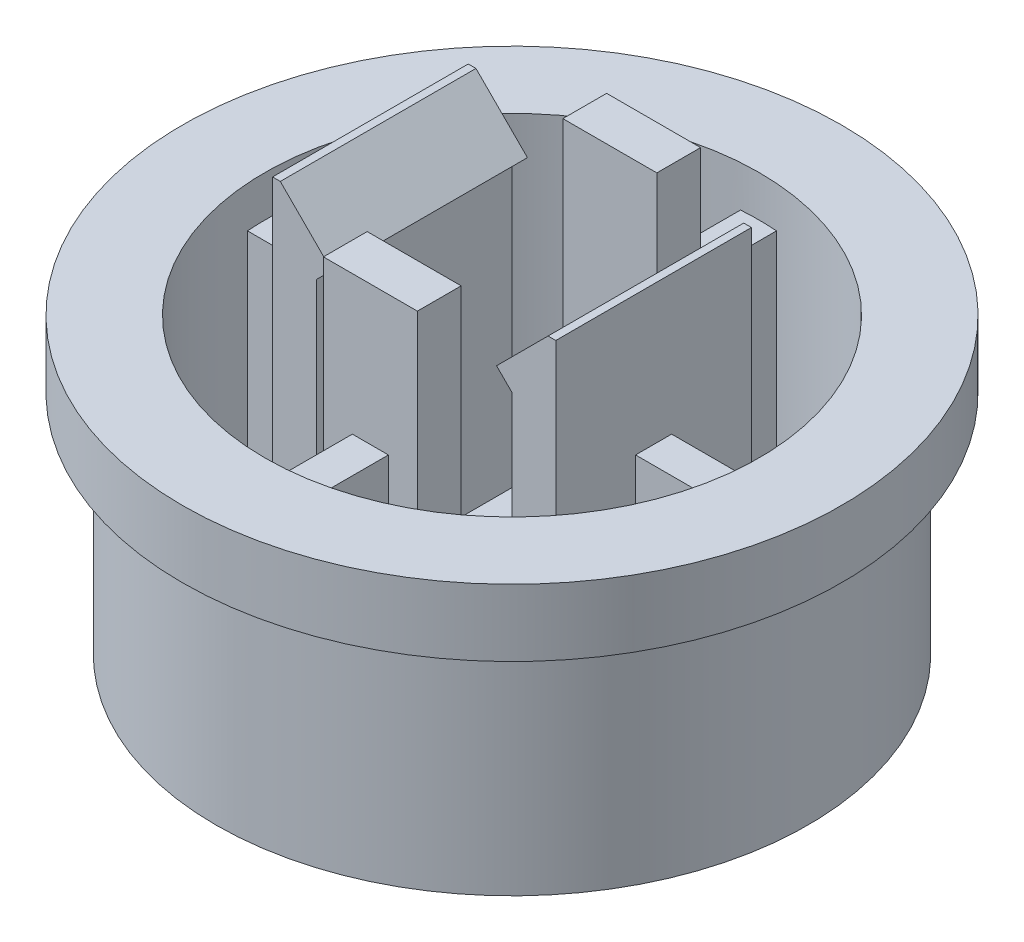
from build123d import *

# Parameters (mm, degrees)
SKETCH_1_R          = 5.75
EXTRUDE_1_DEPTH     = 0.9
SKETCH_2_R          = 5.75
SKETCH_2_R_2        = 4.8
EXTRUDE_2_DEPTH     = 3.5
SKETCH_3_R          = 6.4
SKETCH_3_R_2        = 4.8
EXTRUDE_3_DEPTH     = 1.3
SKETCH_4_W          = 0.85
SKETCH_4_H          = 3.8
SKETCH_4_W_2        = 1.824882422
SKETCH_4_H_2        = 0.85
EXTRUDE_4_DEPTH     = 6.7
EXTRUDE_5_DEPTH     = 3.8
CUT_EXTRUDE_1_REACH = 14.946
EXTRUDE_6_DEPTH     = 4


with BuildPart() as part:
    # Sketch 1 → Extrude 1 (new body)
    with BuildSketch(Plane(origin=(0, 0, 0), x_dir=(1, 0, 0), z_dir=(0, 1, 0))):
        with Locations(Location((0, 0, 0), (0, 0, 270))):
            Circle(SKETCH_1_R)
    extrude(amount=EXTRUDE_1_DEPTH)

    # Sketch 2 → Extrude 2 (add)
    with BuildSketch(Plane(origin=(0, 0.9, 0), x_dir=(1, 0, 0), z_dir=(0, 1, 0))):
        with Locations(Location((0, 0, 0), (0, 0, 270))):
            Circle(SKETCH_2_R)
        with Locations(Location((0, 0, 0), (0, 0, 270))):
            Circle(SKETCH_2_R_2, mode=Mode.SUBTRACT)
    extrude(amount=EXTRUDE_2_DEPTH)

    # Sketch 3 → Extrude 3 (add)
    with BuildSketch(Plane(origin=(0, 4.4, 0), x_dir=(1, 0, 0), z_dir=(0, 1, 0))):
        with Locations(Location((0, 0, 0), (0, 0, 270))):
            Circle(SKETCH_3_R)
        with Locations(Location((0, 0, 0), (0, 0, 270))):
            Circle(SKETCH_3_R_2, mode=Mode.SUBTRACT)
    extrude(amount=EXTRUDE_3_DEPTH)

    # Sketch 4 → Extrude 4 (add)
    with BuildSketch(Plane(origin=(0, 0.9, 0), x_dir=(1, 0, 0), z_dir=(0, 1, 0))):
        with Locations((-2.325, 0)):
            Rectangle(SKETCH_4_W, SKETCH_4_H)
        with Locations((2.325, 0)):
            Rectangle(SKETCH_4_W, SKETCH_4_H)
        with Locations((0, 2.325)):
            Rectangle(SKETCH_4_W_2, SKETCH_4_H_2)
        with Locations((0, -2.325)):
            Rectangle(SKETCH_4_W_2, SKETCH_4_H_2)
    extrude(amount=EXTRUDE_4_DEPTH)

    # Sketch 5 → Extrude 5 (add)
    with BuildSketch(Plane(origin=(0, 0, -1.9), x_dir=(-1, 0, 0), z_dir=(0, 0, -1))):
        Polygon((1.9, 6.3), (1.6, 6.6), (2.6, 7.6), align=None)
        Polygon((-1.9, 6.3), (-1.6, 6.6), (-2.6, 7.6), align=None)
    extrude(amount=-EXTRUDE_5_DEPTH)

    # Sketch 6 → Cut-Extrude 1 (cut, up to next)
    with BuildSketch(Plane(origin=(0, 0, -1.9), x_dir=(-1, 0, 0), z_dir=(0, 0, -1)), mode=Mode.PRIVATE) as cut_extrude_1_sk1:
        Polygon((1.9, 6.9), (2.6, 7.6), (1.9, 7.6), align=None)
    cut_extrude_1_tool1 = extrude(cut_extrude_1_sk1.sketch, amount=-CUT_EXTRUDE_1_REACH, mode=Mode.PRIVATE) & part.part
    # Sketch 6 → Cut-Extrude 1 (cut, up to next)
    with BuildSketch(Plane(origin=(0, 0, -1.9), x_dir=(-1, 0, 0), z_dir=(0, 0, -1)), mode=Mode.PRIVATE) as cut_extrude_1_sk2:
        Polygon((-1.9, 6.9), (-2.6, 7.6), (-1.9, 7.6), align=None)
    cut_extrude_1_tool2 = extrude(cut_extrude_1_sk2.sketch, amount=-CUT_EXTRUDE_1_REACH, mode=Mode.PRIVATE) & part.part
    add(cut_extrude_1_tool1.solids().sort_by_distance((-2.133333, 7.366667, -1.9))[0], mode=Mode.SUBTRACT)
    add(cut_extrude_1_tool2.solids().sort_by_distance((2.133333, 7.366667, -1.9))[0], mode=Mode.SUBTRACT)

    # Sketch 7 → Extrude 6 (add)
    with BuildSketch(Plane(origin=(0, 0.9, 0), x_dir=(1, 0, 0), z_dir=(0, 1, 0))):
        with BuildLine():
            Line((-0.35, -2.75), (0.35, -2.75))
            Line((0.35, -2.75), (0.35, -4.787222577))
            ThreePointArc((0.35, -4.787222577), (0, -4.8), (-0.35, -4.787222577))
            Line((-0.35, -4.787222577), (-0.35, -2.75))
        make_face()
        with BuildLine():
            Line((4.787222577, -0.35), (2.75, -0.35))
            Line((2.75, -0.35), (2.75, 0.35))
            Line((2.75, 0.35), (4.787222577, 0.35))
            ThreePointArc((4.787222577, 0.35), (4.8, 0), (4.787222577, -0.35))
        make_face()
        with BuildLine():
            Line((0.35, 2.75), (0.35, 4.787222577))
            ThreePointArc((0.35, 4.787222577), (0, 4.8), (-0.35, 4.787222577))
            Line((-0.35, 4.787222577), (-0.35, 2.75))
            Line((-0.35, 2.75), (0.35, 2.75))
        make_face()
        with BuildLine():
            Line((-2.75, -0.35), (-4.787222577, -0.35))
            ThreePointArc((-4.787222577, -0.35), (-4.8, 0), (-4.787222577, 0.35))
            Line((-4.787222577, 0.35), (-2.75, 0.35))
            Line((-2.75, 0.35), (-2.75, -0.35))
        make_face()
    extrude(amount=EXTRUDE_6_DEPTH)


solid = part.part
